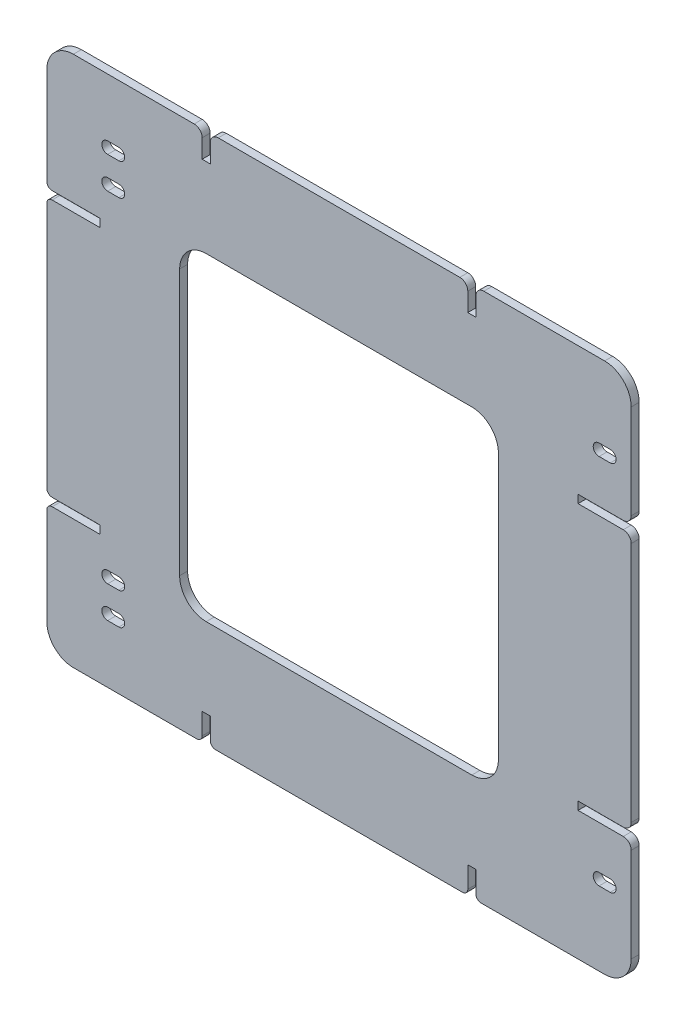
from build123d import *

# Parameters (mm, degrees)
SKETCH_1_W              = 220
SKETCH_1_H              = 200
EXTRUDE_1_DEPTH         = 3
HOLE_WIZARD_4_2_4_2_1_D = 4.2
FILLET_1_R              = 10
SKETCH_4_W              = 120
SKETCH_4_H              = 120
CUT_EXTRUDE_1_DEPTH     = 3
FILLET_2_R              = 10
SKETCH_5_W              = 40
SKETCH_5_H              = 3.05
SKETCH_5_W_2            = 3.05
SKETCH_5_H_2            = 20
CUT_EXTRUDE_2_DEPTH     = 3
FILLET_4_R              = 2
FILLET_5_R              = 3
CUT_EXTRUDE_3_DEPTH     = 10


with BuildPart() as part:
    # Sketch 1 → Extrude 1 (new body)
    with BuildSketch(Plane.XY):
        Rectangle(SKETCH_1_W, SKETCH_1_H)
    extrude(amount=EXTRUDE_1_DEPTH)

    # Hole Wizard 4.2 _4.2_ _1 (through all)
    with Locations(Plane.XY.offset(3)):
        with Locations((-85, 76), (-85, 64), (-85, -76), (-85, -64), (100, -70), (100, 70)):
            Hole(HOLE_WIZARD_4_2_4_2_1_D / 2)

    # Fillet 1
    fillet_1_edges = [part.edges().sort_by_distance(p)[0] for p in [
        (110, -100, 1.5),
        (-110, -100, 1.5),
        (-110, 100, 1.5),
        (110, 100, 1.5),
    ]]
    fillet(fillet_1_edges, radius=FILLET_1_R)

    # Sketch 4 → Cut-Extrude 1 (cut)
    with BuildSketch(Plane.XY.offset(3)):
        Rectangle(SKETCH_4_W, SKETCH_4_H)
    extrude(amount=-CUT_EXTRUDE_1_DEPTH, mode=Mode.SUBTRACT)

    # Fillet 2
    fillet_2_edges = [part.edges().sort_by_distance(p)[0] for p in [
        (60, 60, 1.5),
        (60, -60, 1.5),
        (-60, -60, 1.5),
        (-60, 60, 1.5),
    ]]
    fillet(fillet_2_edges, radius=FILLET_2_R)

    # Sketch 5 → Cut-Extrude 2 (cut)
    with BuildSketch(Plane.XY.offset(3)):
        with Locations((-110, 50)):
            Rectangle(SKETCH_5_W, SKETCH_5_H)
        with Locations((-110, -50)):
            Rectangle(SKETCH_5_W, SKETCH_5_H)
        with Locations((-50, -100)):
            Rectangle(SKETCH_5_W_2, SKETCH_5_H_2)
        with Locations((50, -100)):
            Rectangle(SKETCH_5_W_2, SKETCH_5_H_2)
        with Locations((110, -50)):
            Rectangle(SKETCH_5_W, SKETCH_5_H)
        with Locations((110, 50)):
            Rectangle(SKETCH_5_W, SKETCH_5_H)
        with Locations((50, 100)):
            Rectangle(SKETCH_5_W_2, SKETCH_5_H_2)
        with Locations((-50, 100)):
            Rectangle(SKETCH_5_W_2, SKETCH_5_H_2)
    extrude(amount=-CUT_EXTRUDE_2_DEPTH, mode=Mode.SUBTRACT)

    # Fillet 4
    fillet_4_edges = [part.edges().sort_by_distance(p)[0] for p in [
        (-110, 48.475, 1.5),
        (-110, 51.525, 1.5),
        (51.525, -100, 1.5),
        (48.475, -100, 1.5),
        (-48.475, -100, 1.5),
        (-51.525, -100, 1.5),
        (-110, -51.525, 1.5),
        (-110, -48.475, 1.5),
    ]]
    fillet(fillet_4_edges, radius=FILLET_4_R)

    # Fillet 5
    fillet_5_edges = [part.edges().sort_by_distance(p)[0] for p in [
        (-51.525, 100, 1.5),
        (-48.475, 100, 1.5),
        (48.475, 100, 1.5),
        (51.525, 100, 1.5),
        (110, 48.475, 1.5),
        (110, 51.525, 1.5),
        (110, -51.525, 1.5),
        (110, -48.475, 1.5),
    ]]
    fillet(fillet_5_edges, radius=FILLET_5_R)

    # Sketch 6 → Cut-Extrude 3 (cut)
    with BuildSketch(Plane.XY.offset(3)):
        with BuildLine():
            Line((-87.1, 78.2), (-82.9, 78.2))
            ThreePointArc((-82.9, 78.2), (-80.7, 76), (-82.9, 73.8))
            Line((-82.9, 73.8), (-87.1, 73.8))
            ThreePointArc((-87.1, 73.8), (-89.3, 76), (-87.1, 78.2))
        make_face()
        with BuildLine():
            Line((-87.1, 66.2), (-82.9, 66.2))
            ThreePointArc((-82.9, 66.2), (-80.7, 64), (-82.9, 61.8))
            Line((-82.9, 61.8), (-87.1, 61.8))
            ThreePointArc((-87.1, 61.8), (-89.3, 64), (-87.1, 66.2))
        make_face()
        with BuildLine():
            Line((-87.1, -61.8), (-82.9, -61.8))
            ThreePointArc((-82.9, -61.8), (-80.7, -64), (-82.9, -66.2))
            Line((-82.9, -66.2), (-87.1, -66.2))
            ThreePointArc((-87.1, -66.2), (-89.3, -64), (-87.1, -61.8))
        make_face()
        with BuildLine():
            Line((-87.1, -73.8), (-82.9, -73.8))
            ThreePointArc((-82.9, -73.8), (-80.7, -76), (-82.9, -78.2))
            Line((-82.9, -78.2), (-87.1, -78.2))
            ThreePointArc((-87.1, -78.2), (-89.3, -76), (-87.1, -73.8))
        make_face()
        with BuildLine():
            Line((97.9, 72.2), (102.1, 72.2))
            ThreePointArc((102.1, 72.2), (104.3, 70), (102.1, 67.8))
            Line((102.1, 67.8), (97.9, 67.8))
            ThreePointArc((97.9, 67.8), (95.7, 70), (97.9, 72.2))
        make_face()
        with BuildLine():
            Line((97.9, -67.8), (102.1, -67.8))
            ThreePointArc((102.1, -67.8), (104.3, -70), (102.1, -72.2))
            Line((102.1, -72.2), (97.9, -72.2))
            ThreePointArc((97.9, -72.2), (95.7, -70), (97.9, -67.8))
        make_face()
    extrude(amount=-CUT_EXTRUDE_3_DEPTH, mode=Mode.SUBTRACT)


solid = part.part
